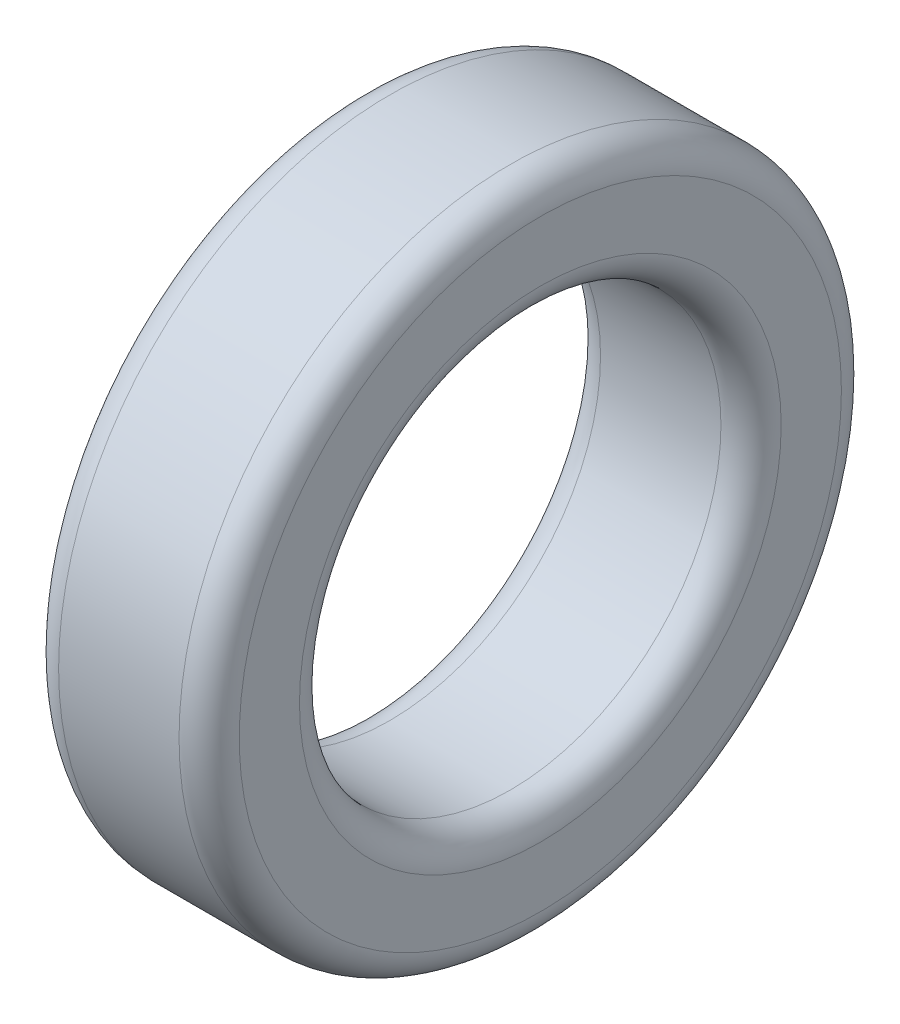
from build123d import *


with BuildPart() as part:
    # Esquisse2 → Base-R_volution (revolve)
    with BuildSketch(Plane.XY.offset(-94.507169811), mode=Mode.PRIVATE) as base_r_volution_sk:
        with BuildLine():
            Line((12.5, -35.328490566), (12.5, -36.328490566))
            ThreePointArc((12.5, -36.328490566), (12.353553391, -36.682043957), (12, -36.828490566))
            Line((12, -36.828490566), (10, -36.828490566))
            ThreePointArc((10, -36.828490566), (9.646446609, -36.682043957), (9.5, -36.328490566))
            Line((9.5, -36.328490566), (9.5, -35.328490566))
            ThreePointArc((9.5, -35.328490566), (9.646446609, -34.974937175), (10, -34.828490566))
            Line((10, -34.828490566), (12, -34.828490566))
            ThreePointArc((12, -34.828490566), (12.353553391, -34.974937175), (12.5, -35.328490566))
        make_face()
    revolve(base_r_volution_sk.sketch.rotate(Axis((19, -40.328490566, -94.507169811), (-1, 0, 0)), 90), axis=Axis((19, -40.328490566, -94.507169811), (-1, 0, 0)))


solid = part.part
